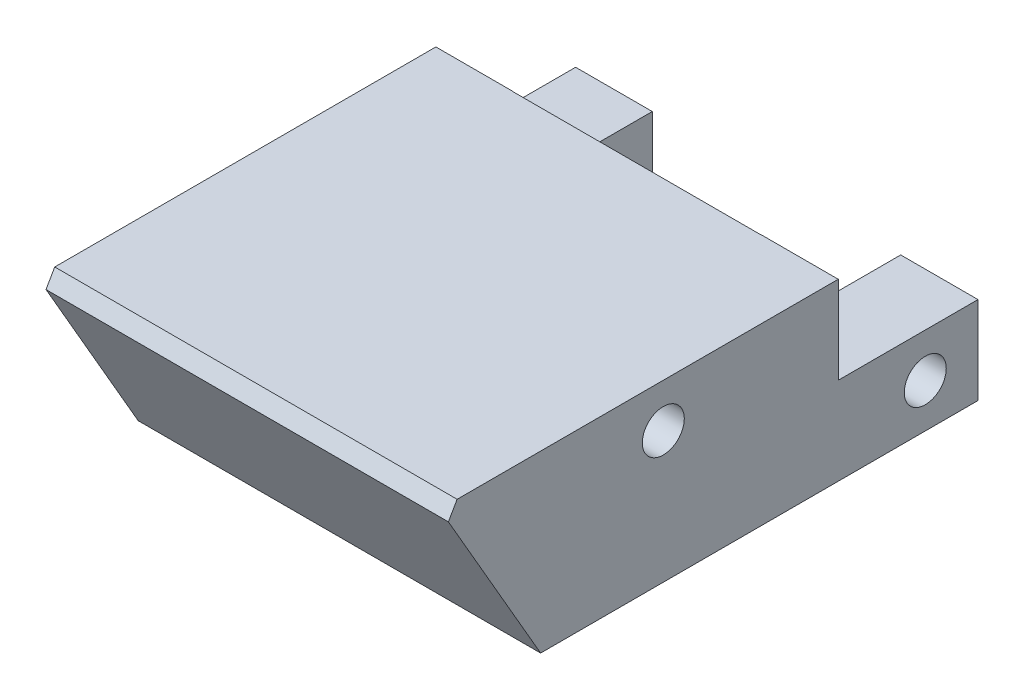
from build123d import *

# Parameters (mm, degrees)
EXTRUDE_1_DEPTH     = 10
SKETCH_3_W          = 23
SKETCH_3_H          = 7.988123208
CUT_EXTRUDE_1_DEPTH = 5
SKETCH_4_R          = 1.2
CUT_EXTRUDE_3_DEPTH = 30
DRAFT_2_ANGLE       = 30
SKETCH_6_R          = 1.2
CUT_EXTRUDE_4_DEPTH = 30
CHAMFER_1_SIZE      = 1


with BuildPart() as part:
    # Sketch 2 → Extrude 1 (new body)
    with BuildSketch(Plane(origin=(0, 0, 0), x_dir=(1, 0, 0), z_dir=(0, 1, 0))):
        Polygon((1.53351822, 3.509610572), (-2.848767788, 3.509610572), (-2.848767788, -21.490389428), (20.151232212, -21.490389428), (20.151232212, 3.509610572), (15.73351822, 3.509610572), (15.73351822, -4.490389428), (1.53351822, -4.490389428), align=None)
    extrude(amount=EXTRUDE_1_DEPTH)

    # Sketch 3 → Cut-Extrude 1 (cut)
    with BuildSketch(Plane(origin=(0, 10, 0), x_dir=(1, 0, 0), z_dir=(0, 1, 0))):
        with Locations((8.651232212, -0.484451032)):
            Rectangle(SKETCH_3_W, SKETCH_3_H)
    extrude(amount=-CUT_EXTRUDE_1_DEPTH, mode=Mode.SUBTRACT)

    # Sketch 4 → Cut-Extrude 3 (cut)
    with BuildSketch(Plane(origin=(20.151232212, 0, 0), x_dir=(0, 0, -1), z_dir=(1, 0, 0))):
        with Locations((0.495365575, 2.5)):
            Circle(SKETCH_4_R)
    extrude(amount=-CUT_EXTRUDE_3_DEPTH, mode=Mode.SUBTRACT)

    # Draft 2
    draft_2_faces = [part.faces().sort_by_distance(p)[0] for p in [
        (8.651232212, 5, 21.490389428),
    ]]
    draft(draft_2_faces, Plane(origin=(0, 0, 0), x_dir=(0, 0, -1), z_dir=(0, -1, 0)), DRAFT_2_ANGLE)

    # Sketch 6 → Cut-Extrude 4 (cut)
    with BuildSketch(Plane.ZY.offset(2.848767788)):
        with Locations((14.478512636, 7.5)):
            Circle(SKETCH_6_R)
    extrude(amount=-CUT_EXTRUDE_4_DEPTH, mode=Mode.SUBTRACT)

    # Chamfer 1
    chamfer_1_edges = [part.edges().sort_by_distance(p)[0] for p in [
        (8.651232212, 10, 27.26389212),
    ]]
    chamfer(chamfer_1_edges, length=CHAMFER_1_SIZE)


solid = part.part
